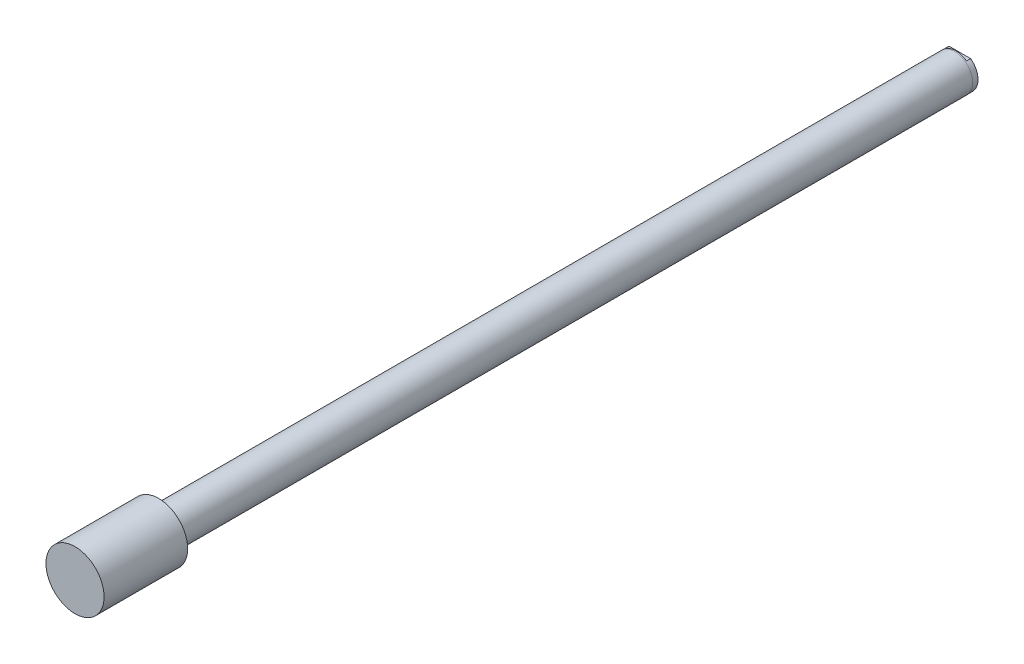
ISO-10303-21;
HEADER;
FILE_DESCRIPTION(('STEP AP214'),'2;1');
FILE_NAME('part.step','',(''),(''),'','','');
FILE_SCHEMA(('AUTOMOTIVE_DESIGN { 1 0 10303 214 1 1 1 1 }'));
ENDSEC;
DATA;
#1=APPLICATION_CONTEXT('core data for automotive mechanical design processes');
#2=APPLICATION_PROTOCOL_DEFINITION('international standard','automotive_design',2000,#1);
#3=PRODUCT_CONTEXT('',#1,'mechanical');
#4=PRODUCT('Part','Part','',(#3));
#5=PRODUCT_RELATED_PRODUCT_CATEGORY('part','',(#4));
#6=PRODUCT_DEFINITION_FORMATION('','',#4);
#7=PRODUCT_DEFINITION_CONTEXT('part definition',#1,'design');
#8=PRODUCT_DEFINITION('design','',#6,#7);
#9=PRODUCT_DEFINITION_SHAPE('','',#8);
#10=(LENGTH_UNIT() NAMED_UNIT(*) SI_UNIT(.MILLI.,.METRE.));
#11=(NAMED_UNIT(*) PLANE_ANGLE_UNIT() SI_UNIT($,.RADIAN.));
#12=(NAMED_UNIT(*) SI_UNIT($,.STERADIAN.) SOLID_ANGLE_UNIT());
#13=UNCERTAINTY_MEASURE_WITH_UNIT(LENGTH_MEASURE(1.E-05),#10,'distance_accuracy_value','');
#14=(GEOMETRIC_REPRESENTATION_CONTEXT(3) GLOBAL_UNCERTAINTY_ASSIGNED_CONTEXT((#13)) GLOBAL_UNIT_ASSIGNED_CONTEXT((#10,
#11,#12)) REPRESENTATION_CONTEXT('',''));
#15=CARTESIAN_POINT('',(0.,0.,0.));
#16=DIRECTION('',(0.,0.,1.));
#17=DIRECTION('',(1.,0.,0.));
#18=AXIS2_PLACEMENT_3D('',#15,#16,#17);
#19=CARTESIAN_POINT('',(0.,0.,27.7368));
#20=DIRECTION('',(0.,0.,-1.));
#21=DIRECTION('',(-1.,0.,0.));
#22=AXIS2_PLACEMENT_3D('',#19,#20,#21);
#23=CONICAL_SURFACE('',#22,4.96062,1.02974425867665);
#24=CARTESIAN_POINT('',(0.,0.,30.7174412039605));
#25=VERTEX_POINT('',#24);
#26=VERTEX_LOOP('',#25);
#27=FACE_BOUND('',#26,.T.);
#28=CARTESIAN_POINT('',(0.,0.,27.7368));
#29=DIRECTION('',(0.,0.,-1.));
#30=DIRECTION('',(-1.,0.,0.));
#31=AXIS2_PLACEMENT_3D('',#28,#29,#30);
#32=CIRCLE('',#31,4.96062);
#33=CARTESIAN_POINT('',(-4.96062,0.,27.7368));
#34=VERTEX_POINT('',#33);
#35=EDGE_CURVE('E93',#34,#34,#32,.T.);
#36=ORIENTED_EDGE('',*,*,#35,.T.);
#37=EDGE_LOOP('',(#36));
#38=FACE_BOUND('',#37,.T.);
#39=ADVANCED_FACE('F16',(#27,#38),#23,.F.);
#40=CARTESIAN_POINT('',(0.,0.,-4.7752));
#41=DIRECTION('',(0.,0.,-1.));
#42=DIRECTION('',(-1.,0.,0.));
#43=AXIS2_PLACEMENT_3D('',#40,#41,#42);
#44=CYLINDRICAL_SURFACE('',#43,4.96062);
#45=ORIENTED_EDGE('',*,*,#35,.F.);
#46=EDGE_LOOP('',(#45));
#47=FACE_BOUND('',#46,.T.);
#48=CARTESIAN_POINT('',(0.,0.,-4.7752));
#49=DIRECTION('',(0.,0.,-1.));
#50=DIRECTION('',(-1.,0.,0.));
#51=AXIS2_PLACEMENT_3D('',#48,#49,#50);
#52=CIRCLE('',#51,4.96062);
#53=CARTESIAN_POINT('',(-4.96062,0.,-4.7752));
#54=VERTEX_POINT('',#53);
#55=EDGE_CURVE('E97',#54,#54,#52,.T.);
#56=ORIENTED_EDGE('',*,*,#55,.T.);
#57=EDGE_LOOP('',(#56));
#58=FACE_BOUND('',#57,.T.);
#59=ADVANCED_FACE('F131',(#47,#58),#44,.F.);
#60=CARTESIAN_POINT('',(0.,0.,-1.2192));
#61=DIRECTION('',(0.,0.,-1.));
#62=DIRECTION('',(-1.,0.,0.));
#63=AXIS2_PLACEMENT_3D('',#60,#61,#62);
#64=PLANE('',#63);
#65=CARTESIAN_POINT('',(0.,0.,-1.2192));
#66=DIRECTION('',(0.,0.,-1.));
#67=DIRECTION('',(-1.,0.,0.));
#68=AXIS2_PLACEMENT_3D('',#65,#66,#67);
#69=CIRCLE('',#68,15.7607);
#70=CARTESIAN_POINT('',(9.33325583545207,-12.7,-1.2192));
#71=VERTEX_POINT('',#70);
#72=CARTESIAN_POINT('',(-9.33325583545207,-12.7,-1.2192));
#73=VERTEX_POINT('',#72);
#74=EDGE_CURVE('E65',#71,#73,#69,.T.);
#75=ORIENTED_EDGE('',*,*,#74,.T.);
#76=DIRECTION('',(1.,0.,0.));
#77=VECTOR('',#76,1.);
#78=CARTESIAN_POINT('',(9.33325583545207,-12.7,-1.2192));
#79=LINE('',#78,#77);
#80=EDGE_CURVE('E67',#73,#71,#79,.T.);
#81=ORIENTED_EDGE('',*,*,#80,.T.);
#82=EDGE_LOOP('',(#75,#81));
#83=FACE_BOUND('',#82,.T.);
#84=ADVANCED_FACE('F66',(#83),#64,.T.);
#85=CARTESIAN_POINT('',(0.,0.,-1.2192));
#86=DIRECTION('',(0.,0.,-1.));
#87=DIRECTION('',(-1.,0.,0.));
#88=AXIS2_PLACEMENT_3D('',#85,#86,#87);
#89=PLANE('',#88);
#90=CARTESIAN_POINT('',(0.,0.,-1.2192));
#91=DIRECTION('',(0.,0.,-1.));
#92=DIRECTION('',(-1.,0.,0.));
#93=AXIS2_PLACEMENT_3D('',#90,#91,#92);
#94=CIRCLE('',#93,15.7607);
#95=CARTESIAN_POINT('',(-9.33325583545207,12.7,-1.2192));
#96=VERTEX_POINT('',#95);
#97=CARTESIAN_POINT('',(9.33325583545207,12.7,-1.2192));
#98=VERTEX_POINT('',#97);
#99=EDGE_CURVE('E85',#96,#98,#94,.T.);
#100=ORIENTED_EDGE('',*,*,#99,.T.);
#101=DIRECTION('',(-1.,0.,0.));
#102=VECTOR('',#101,1.);
#103=CARTESIAN_POINT('',(9.33325583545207,12.7,-1.2192));
#104=LINE('',#103,#102);
#105=EDGE_CURVE('E87',#98,#96,#104,.T.);
#106=ORIENTED_EDGE('',*,*,#105,.T.);
#107=EDGE_LOOP('',(#100,#106));
#108=FACE_BOUND('',#107,.T.);
#109=ADVANCED_FACE('F121',(#108),#89,.T.);
#110=CARTESIAN_POINT('',(9.33325583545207,12.7,-1.2192));
#111=DIRECTION('',(0.,-1.,0.));
#112=DIRECTION('',(0.,0.,1.));
#113=AXIS2_PLACEMENT_3D('',#110,#111,#112);
#114=PLANE('',#113);
#115=DIRECTION('',(-1.,0.,0.));
#116=VECTOR('',#115,1.);
#117=CARTESIAN_POINT('',(9.33325583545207,12.7,-4.7752));
#118=LINE('',#117,#116);
#119=CARTESIAN_POINT('',(9.33325583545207,12.7,-4.7752));
#120=VERTEX_POINT('',#119);
#121=CARTESIAN_POINT('',(-9.33325583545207,12.7,-4.7752));
#122=VERTEX_POINT('',#121);
#123=EDGE_CURVE('E81',#120,#122,#118,.T.);
#124=ORIENTED_EDGE('',*,*,#123,.T.);
#125=DIRECTION('',(0.,0.,-1.));
#126=VECTOR('',#125,1.);
#127=CARTESIAN_POINT('',(-9.33325583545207,12.7,-1.2192));
#128=LINE('',#127,#126);
#129=EDGE_CURVE('E91',#96,#122,#128,.T.);
#130=ORIENTED_EDGE('',*,*,#129,.F.);
#131=ORIENTED_EDGE('',*,*,#105,.F.);
#132=DIRECTION('',(0.,0.,-1.));
#133=VECTOR('',#132,1.);
#134=CARTESIAN_POINT('',(9.33325583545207,12.7,-1.2192));
#135=LINE('',#134,#133);
#136=EDGE_CURVE('E41',#98,#120,#135,.T.);
#137=ORIENTED_EDGE('',*,*,#136,.T.);
#138=EDGE_LOOP('',(#124,#130,#131,#137));
#139=FACE_BOUND('',#138,.T.);
#140=ADVANCED_FACE('F118',(#139),#114,.F.);
#141=CARTESIAN_POINT('',(0.,0.,-4.7752));
#142=DIRECTION('',(0.,0.,-1.));
#143=DIRECTION('',(-1.,0.,0.));
#144=AXIS2_PLACEMENT_3D('',#141,#142,#143);
#145=PLANE('',#144);
#146=DIRECTION('',(1.,0.,0.));
#147=VECTOR('',#146,1.);
#148=CARTESIAN_POINT('',(9.33325583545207,-12.7,-4.7752));
#149=LINE('',#148,#147);
#150=CARTESIAN_POINT('',(-9.33325583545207,-12.7,-4.7752));
#151=VERTEX_POINT('',#150);
#152=CARTESIAN_POINT('',(9.33325583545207,-12.7,-4.7752));
#153=VERTEX_POINT('',#152);
#154=EDGE_CURVE('E70',#151,#153,#149,.T.);
#155=ORIENTED_EDGE('',*,*,#154,.F.);
#156=CARTESIAN_POINT('',(0.,0.,-4.7752));
#157=DIRECTION('',(0.,0.,-1.));
#158=DIRECTION('',(-1.,0.,0.));
#159=AXIS2_PLACEMENT_3D('',#156,#157,#158);
#160=CIRCLE('',#159,15.7607);
#161=EDGE_CURVE('E79',#151,#122,#160,.T.);
#162=ORIENTED_EDGE('',*,*,#161,.T.);
#163=ORIENTED_EDGE('',*,*,#123,.F.);
#164=EDGE_CURVE('E25',#120,#153,#160,.T.);
#165=ORIENTED_EDGE('',*,*,#164,.T.);
#166=EDGE_LOOP('',(#155,#162,#163,#165));
#167=FACE_BOUND('',#166,.T.);
#168=ORIENTED_EDGE('',*,*,#55,.F.);
#169=EDGE_LOOP('',(#168));
#170=FACE_BOUND('',#169,.T.);
#171=ADVANCED_FACE('F116',(#167,#170),#145,.T.);
#172=CARTESIAN_POINT('',(9.33325583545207,-12.7,-1.2192));
#173=DIRECTION('',(0.,1.,0.));
#174=DIRECTION('',(0.,0.,-1.));
#175=AXIS2_PLACEMENT_3D('',#172,#173,#174);
#176=PLANE('',#175);
#177=ORIENTED_EDGE('',*,*,#154,.T.);
#178=DIRECTION('',(0.,0.,-1.));
#179=VECTOR('',#178,1.);
#180=CARTESIAN_POINT('',(9.33325583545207,-12.7,-1.2192));
#181=LINE('',#180,#179);
#182=EDGE_CURVE('E73',#71,#153,#181,.T.);
#183=ORIENTED_EDGE('',*,*,#182,.F.);
#184=ORIENTED_EDGE('',*,*,#80,.F.);
#185=DIRECTION('',(0.,0.,-1.));
#186=VECTOR('',#185,1.);
#187=CARTESIAN_POINT('',(-9.33325583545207,-12.7,-1.2192));
#188=LINE('',#187,#186);
#189=EDGE_CURVE('E33',#73,#151,#188,.T.);
#190=ORIENTED_EDGE('',*,*,#189,.T.);
#191=EDGE_LOOP('',(#177,#183,#184,#190));
#192=FACE_BOUND('',#191,.T.);
#193=ADVANCED_FACE('F72',(#192),#176,.F.);
#194=CARTESIAN_POINT('',(0.,0.,0.));
#195=DIRECTION('',(0.,0.,-1.));
#196=DIRECTION('',(-1.,0.,0.));
#197=AXIS2_PLACEMENT_3D('',#194,#195,#196);
#198=CYLINDRICAL_SURFACE('',#197,15.7607);
#199=ORIENTED_EDGE('',*,*,#182,.T.);
#200=ORIENTED_EDGE('',*,*,#164,.F.);
#201=ORIENTED_EDGE('',*,*,#136,.F.);
#202=ORIENTED_EDGE('',*,*,#99,.F.);
#203=ORIENTED_EDGE('',*,*,#129,.T.);
#204=ORIENTED_EDGE('',*,*,#161,.F.);
#205=ORIENTED_EDGE('',*,*,#189,.F.);
#206=ORIENTED_EDGE('',*,*,#74,.F.);
#207=EDGE_LOOP('',(#199,#200,#201,#202,#203,#204,#205,#206));
#208=FACE_BOUND('',#207,.T.);
#209=CARTESIAN_POINT('',(0.,0.,0.));
#210=DIRECTION('',(0.,0.,-1.));
#211=DIRECTION('',(-1.,0.,0.));
#212=AXIS2_PLACEMENT_3D('',#209,#210,#211);
#213=CIRCLE('',#212,15.7607);
#214=CARTESIAN_POINT('',(-15.7607,0.,0.));
#215=VERTEX_POINT('',#214);
#216=EDGE_CURVE('E10',#215,#215,#213,.T.);
#217=ORIENTED_EDGE('',*,*,#216,.T.);
#218=EDGE_LOOP('',(#217));
#219=FACE_BOUND('',#218,.T.);
#220=ADVANCED_FACE('F76',(#208,#219),#198,.T.);
#221=CARTESIAN_POINT('',(0.,0.,768.5024));
#222=DIRECTION('',(0.,0.,1.));
#223=DIRECTION('',(1.,0.,0.));
#224=AXIS2_PLACEMENT_3D('',#221,#222,#223);
#225=PLANE('',#224);
#226=CARTESIAN_POINT('',(0.,0.,768.5024));
#227=DIRECTION('',(0.,0.,1.));
#228=DIRECTION('',(1.,0.,0.));
#229=AXIS2_PLACEMENT_3D('',#226,#227,#228);
#230=CIRCLE('',#229,25.4);
#231=CARTESIAN_POINT('',(25.4,0.,768.5024));
#232=VERTEX_POINT('',#231);
#233=EDGE_CURVE('E102',#232,#232,#230,.T.);
#234=ORIENTED_EDGE('',*,*,#233,.T.);
#235=EDGE_LOOP('',(#234));
#236=FACE_BOUND('',#235,.T.);
#237=ADVANCED_FACE('F149',(#236),#225,.T.);
#238=CARTESIAN_POINT('',(0.,0.,768.5024));
#239=DIRECTION('',(0.,0.,-1.));
#240=DIRECTION('',(-1.,0.,0.));
#241=AXIS2_PLACEMENT_3D('',#238,#239,#240);
#242=CYLINDRICAL_SURFACE('',#241,25.4);
#243=ORIENTED_EDGE('',*,*,#233,.F.);
#244=EDGE_LOOP('',(#243));
#245=FACE_BOUND('',#244,.T.);
#246=CARTESIAN_POINT('',(0.,0.,695.4774));
#247=DIRECTION('',(0.,0.,1.));
#248=DIRECTION('',(1.,0.,0.));
#249=AXIS2_PLACEMENT_3D('',#246,#247,#248);
#250=CIRCLE('',#249,25.4);
#251=CARTESIAN_POINT('',(25.4,0.,695.4774));
#252=VERTEX_POINT('',#251);
#253=EDGE_CURVE('E106',#252,#252,#250,.T.);
#254=ORIENTED_EDGE('',*,*,#253,.T.);
#255=EDGE_LOOP('',(#254));
#256=FACE_BOUND('',#255,.T.);
#257=ADVANCED_FACE('F152',(#245,#256),#242,.T.);
#258=CARTESIAN_POINT('',(0.,0.,695.4774));
#259=DIRECTION('',(0.,0.,1.));
#260=DIRECTION('',(1.,0.,0.));
#261=AXIS2_PLACEMENT_3D('',#258,#259,#260);
#262=PLANE('',#261);
#263=CARTESIAN_POINT('',(0.,0.,695.4774));
#264=DIRECTION('',(0.,0.,1.));
#265=DIRECTION('',(1.,0.,0.));
#266=AXIS2_PLACEMENT_3D('',#263,#264,#265);
#267=CIRCLE('',#266,15.875);
#268=CARTESIAN_POINT('',(15.875,0.,695.4774));
#269=VERTEX_POINT('',#268);
#270=EDGE_CURVE('E105',#269,#269,#267,.F.);
#271=ORIENTED_EDGE('',*,*,#270,.F.);
#272=EDGE_LOOP('',(#271));
#273=FACE_BOUND('',#272,.T.);
#274=ORIENTED_EDGE('',*,*,#253,.F.);
#275=EDGE_LOOP('',(#274));
#276=FACE_BOUND('',#275,.T.);
#277=ADVANCED_FACE('F154',(#273,#276),#262,.F.);
#278=CARTESIAN_POINT('',(0.,0.,695.4774));
#279=DIRECTION('',(0.,0.,-1.));
#280=DIRECTION('',(-1.,0.,0.));
#281=AXIS2_PLACEMENT_3D('',#278,#279,#280);
#282=CYLINDRICAL_SURFACE('',#281,15.875);
#283=CARTESIAN_POINT('',(0.,0.,0.));
#284=DIRECTION('',(0.,0.,-1.));
#285=DIRECTION('',(-1.,0.,0.));
#286=AXIS2_PLACEMENT_3D('',#283,#284,#285);
#287=CIRCLE('',#286,15.875);
#288=CARTESIAN_POINT('',(-15.875,0.,0.));
#289=VERTEX_POINT('',#288);
#290=EDGE_CURVE('E20',#289,#289,#287,.T.);
#291=ORIENTED_EDGE('',*,*,#290,.F.);
#292=EDGE_LOOP('',(#291));
#293=FACE_BOUND('',#292,.T.);
#294=ORIENTED_EDGE('',*,*,#270,.T.);
#295=EDGE_LOOP('',(#294));
#296=FACE_BOUND('',#295,.T.);
#297=ADVANCED_FACE('F18',(#293,#296),#282,.T.);
#298=CARTESIAN_POINT('',(0.,0.,0.));
#299=DIRECTION('',(0.,0.,-1.));
#300=DIRECTION('',(-1.,0.,0.));
#301=AXIS2_PLACEMENT_3D('',#298,#299,#300);
#302=PLANE('',#301);
#303=ORIENTED_EDGE('',*,*,#290,.T.);
#304=EDGE_LOOP('',(#303));
#305=FACE_BOUND('',#304,.T.);
#306=ORIENTED_EDGE('',*,*,#216,.F.);
#307=EDGE_LOOP('',(#306));
#308=FACE_BOUND('',#307,.T.);
#309=ADVANCED_FACE('F158',(#305,#308),#302,.T.);
#310=CLOSED_SHELL('',(#39,#59,#84,#109,#140,#171,#193,#220,#237,#257,#277,#297,#309));
#311=MANIFOLD_SOLID_BREP('B1',#310);
#312=ADVANCED_BREP_SHAPE_REPRESENTATION('',(#18,#311),#14);
#313=SHAPE_DEFINITION_REPRESENTATION(#9,#312);
ENDSEC;
END-ISO-10303-21;
